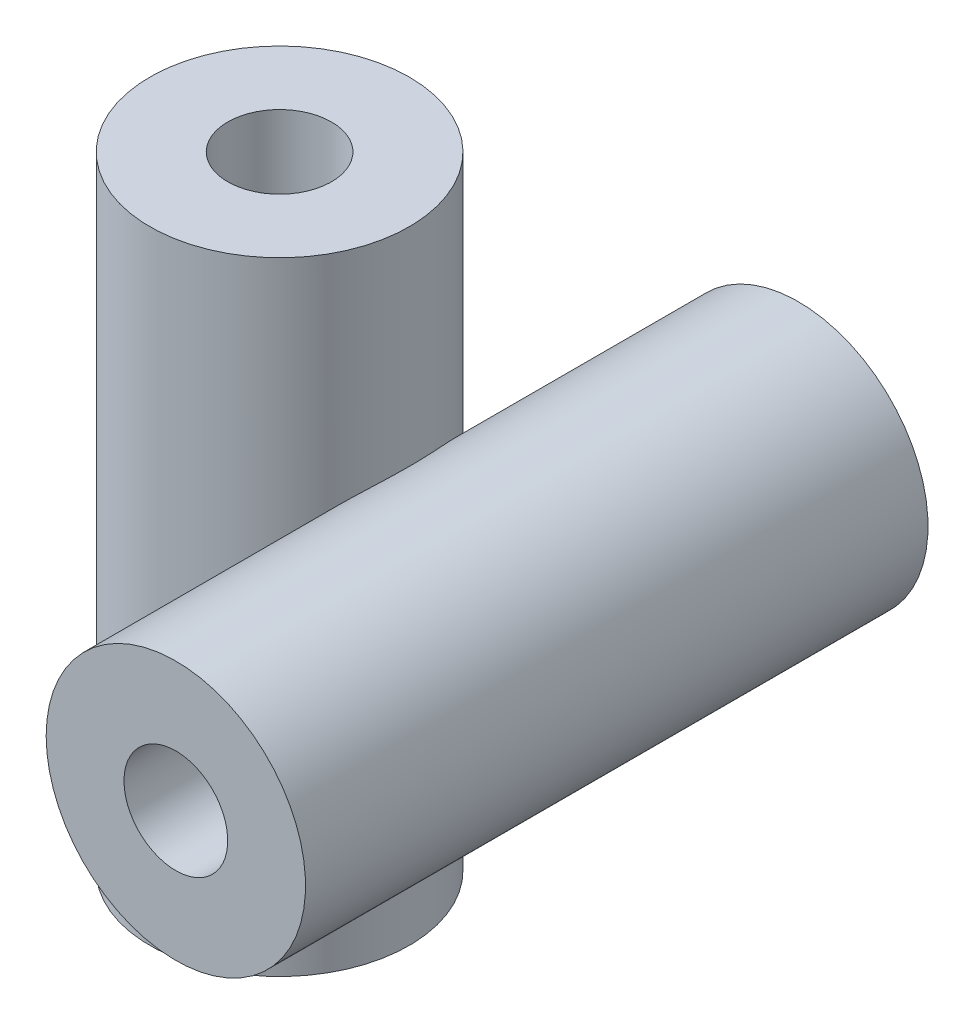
ISO-10303-21;
HEADER;
FILE_DESCRIPTION(('STEP AP214'),'2;1');
FILE_NAME('part.step','',(''),(''),'','','');
FILE_SCHEMA(('AUTOMOTIVE_DESIGN { 1 0 10303 214 1 1 1 1 }'));
ENDSEC;
DATA;
#1=APPLICATION_CONTEXT('core data for automotive mechanical design processes');
#2=APPLICATION_PROTOCOL_DEFINITION('international standard','automotive_design',2000,#1);
#3=PRODUCT_CONTEXT('',#1,'mechanical');
#4=PRODUCT('Part','Part','',(#3));
#5=PRODUCT_RELATED_PRODUCT_CATEGORY('part','',(#4));
#6=PRODUCT_DEFINITION_FORMATION('','',#4);
#7=PRODUCT_DEFINITION_CONTEXT('part definition',#1,'design');
#8=PRODUCT_DEFINITION('design','',#6,#7);
#9=PRODUCT_DEFINITION_SHAPE('','',#8);
#10=(LENGTH_UNIT() NAMED_UNIT(*) SI_UNIT(.MILLI.,.METRE.));
#11=(NAMED_UNIT(*) PLANE_ANGLE_UNIT() SI_UNIT($,.RADIAN.));
#12=(NAMED_UNIT(*) SI_UNIT($,.STERADIAN.) SOLID_ANGLE_UNIT());
#13=UNCERTAINTY_MEASURE_WITH_UNIT(LENGTH_MEASURE(1.E-05),#10,'distance_accuracy_value','');
#14=(GEOMETRIC_REPRESENTATION_CONTEXT(3) GLOBAL_UNCERTAINTY_ASSIGNED_CONTEXT((#13)) GLOBAL_UNIT_ASSIGNED_CONTEXT((#10,
#11,#12)) REPRESENTATION_CONTEXT('',''));
#15=CARTESIAN_POINT('',(0.,0.,0.));
#16=DIRECTION('',(0.,0.,1.));
#17=DIRECTION('',(1.,0.,0.));
#18=AXIS2_PLACEMENT_3D('',#15,#16,#17);
#19=CARTESIAN_POINT('',(15.0000009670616,0.,15.0021082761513));
#20=DIRECTION('',(0.,0.,-1.));
#21=DIRECTION('',(-1.,0.,0.));
#22=AXIS2_PLACEMENT_3D('',#19,#20,#21);
#23=CYLINDRICAL_SURFACE('',#22,6.24999999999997);
#24=CARTESIAN_POINT('',(8.75000096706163,0.,4.99999967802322));
#25=CARTESIAN_POINT('',(8.74999874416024,0.135020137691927,4.99999813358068));
#26=CARTESIAN_POINT('',(8.75437965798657,0.270014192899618,4.99672377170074));
#27=CARTESIAN_POINT('',(8.77183991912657,0.539154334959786,4.98355854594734));
#28=CARTESIAN_POINT('',(8.78492084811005,0.673300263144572,4.97366647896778));
#29=CARTESIAN_POINT('',(8.81961695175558,0.939916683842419,4.94707046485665));
#30=CARTESIAN_POINT('',(8.8412393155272,1.07238566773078,4.93036077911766));
#31=CARTESIAN_POINT('',(8.89269726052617,1.33461259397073,4.8898348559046));
#32=CARTESIAN_POINT('',(8.92253246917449,1.46437065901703,4.86601894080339));
#33=CARTESIAN_POINT('',(8.99001529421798,1.72050794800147,4.81084036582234));
#34=CARTESIAN_POINT('',(9.02767915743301,1.8468795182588,4.77946198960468));
#35=CARTESIAN_POINT('',(9.1101300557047,2.09499615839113,4.70874545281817));
#36=CARTESIAN_POINT('',(9.1549171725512,2.21674117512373,4.66940720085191));
#37=CARTESIAN_POINT('',(9.25073425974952,2.45455804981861,4.58235179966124));
#38=CARTESIAN_POINT('',(9.30176021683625,2.57063348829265,4.53464002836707));
#39=CARTESIAN_POINT('',(9.40901852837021,2.79625013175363,4.43042303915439));
#40=CARTESIAN_POINT('',(9.46525062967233,2.90579165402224,4.37391824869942));
#41=CARTESIAN_POINT('',(9.57976450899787,3.11403222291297,4.25381220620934));
#42=CARTESIAN_POINT('',(9.63792030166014,3.21296793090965,4.19050122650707));
#43=CARTESIAN_POINT('',(9.7566170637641,3.40323349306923,4.05526698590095));
#44=CARTESIAN_POINT('',(9.81715798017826,3.49456351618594,3.9833439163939));
#45=CARTESIAN_POINT('',(9.93919396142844,3.6690692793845,3.83097783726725));
#46=CARTESIAN_POINT('',(10.0006887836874,3.75224705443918,3.75053696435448));
#47=CARTESIAN_POINT('',(10.1231837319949,3.91013297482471,3.58139559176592));
#48=CARTESIAN_POINT('',(10.1841838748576,3.9848414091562,3.49269537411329));
#49=CARTESIAN_POINT('',(10.3007885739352,4.12159071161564,3.31284830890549));
#50=CARTESIAN_POINT('',(10.356501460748,4.18411354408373,3.22213722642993));
#51=CARTESIAN_POINT('',(10.4651041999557,4.30158276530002,3.03429024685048));
#52=CARTESIAN_POINT('',(10.5179930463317,4.35652646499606,2.93715208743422));
#53=CARTESIAN_POINT('',(10.6198971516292,4.45896986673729,2.7371265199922));
#54=CARTESIAN_POINT('',(10.6689131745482,4.50647103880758,2.63424025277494));
#55=CARTESIAN_POINT('',(10.7622235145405,4.59432828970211,2.42334333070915));
#56=CARTESIAN_POINT('',(10.8065156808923,4.63468111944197,2.31533037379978));
#57=CARTESIAN_POINT('',(10.8907019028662,4.70950286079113,2.09206679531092));
#58=CARTESIAN_POINT('',(10.9304509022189,4.74379060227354,1.97670082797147));
#59=CARTESIAN_POINT('',(11.0035208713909,4.80551080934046,1.74221824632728));
#60=CARTESIAN_POINT('',(11.0368442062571,4.83294579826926,1.6231030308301));
#61=CARTESIAN_POINT('',(11.0966079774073,4.88134239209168,1.3817898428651));
#62=CARTESIAN_POINT('',(11.1230440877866,4.90229992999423,1.25958998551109));
#63=CARTESIAN_POINT('',(11.1686371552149,4.9380147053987,1.0129893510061));
#64=CARTESIAN_POINT('',(11.1877962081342,4.95277372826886,0.888589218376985));
#65=CARTESIAN_POINT('',(11.2197030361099,4.97717618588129,0.629333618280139));
#66=CARTESIAN_POINT('',(11.2318932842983,4.98637747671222,0.494367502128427));
#67=CARTESIAN_POINT('',(11.2474703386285,4.99811046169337,0.223637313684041));
#68=CARTESIAN_POINT('',(11.2508567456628,5.00064185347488,0.0878732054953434));
#69=CARTESIAN_POINT('',(11.2487786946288,4.99908326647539,-0.183593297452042));
#70=CARTESIAN_POINT('',(11.2433114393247,4.99499119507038,-0.319295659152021));
#71=CARTESIAN_POINT('',(11.2235963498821,4.98010241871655,-0.589692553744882));
#72=CARTESIAN_POINT('',(11.2093484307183,4.96930564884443,-0.724387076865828));
#73=CARTESIAN_POINT('',(11.1716528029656,4.94032749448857,-0.996333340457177));
#74=CARTESIAN_POINT('',(11.1479132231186,4.92191111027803,-1.13351984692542));
#75=CARTESIAN_POINT('',(11.0916507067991,4.87735426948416,-1.4048113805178));
#76=CARTESIAN_POINT('',(11.059127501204,4.8512135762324,-1.53891631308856));
#77=CARTESIAN_POINT('',(10.9858711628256,4.79077392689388,-1.80294815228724));
#78=CARTESIAN_POINT('',(10.9451402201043,4.75647714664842,-1.93287616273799));
#79=CARTESIAN_POINT('',(10.8562355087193,4.67922782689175,-2.18750996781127));
#80=CARTESIAN_POINT('',(10.8080621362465,4.63627574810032,-2.31221603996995));
#81=CARTESIAN_POINT('',(10.7070499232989,4.54286636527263,-2.55114346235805));
#82=CARTESIAN_POINT('',(10.6544292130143,4.49271889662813,-2.66557806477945));
#83=CARTESIAN_POINT('',(10.5443045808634,4.38352350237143,-2.88765629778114));
#84=CARTESIAN_POINT('',(10.486800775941,4.32447578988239,-2.99530009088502));
#85=CARTESIAN_POINT('',(10.3682676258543,4.19727231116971,-3.20288835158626));
#86=CARTESIAN_POINT('',(10.3072405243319,4.12912230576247,-3.30283762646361));
#87=CARTESIAN_POINT('',(10.1831149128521,3.98362220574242,-3.49440388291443));
#88=CARTESIAN_POINT('',(10.1200165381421,3.90627271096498,-3.58602140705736));
#89=CARTESIAN_POINT('',(9.99790426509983,3.74843356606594,-3.75412752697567));
#90=CARTESIAN_POINT('',(9.93892350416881,3.66857132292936,-3.83123050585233));
#91=CARTESIAN_POINT('',(9.82183684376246,3.50136115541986,-3.97758536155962));
#92=CARTESIAN_POINT('',(9.76373094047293,3.41401326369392,-4.04683727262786));
#93=CARTESIAN_POINT('',(9.64964295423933,3.23228696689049,-4.17742189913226));
#94=CARTESIAN_POINT('',(9.59366102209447,3.13790806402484,-4.23875405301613));
#95=CARTESIAN_POINT('',(9.48498376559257,2.94271345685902,-4.35358294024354));
#96=CARTESIAN_POINT('',(9.43228849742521,2.8418976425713,-4.40707953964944));
#97=CARTESIAN_POINT('',(9.33189440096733,2.63590967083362,-4.50578444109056));
#98=CARTESIAN_POINT('',(9.28413800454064,2.53081414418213,-4.55109434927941));
#99=CARTESIAN_POINT('',(9.19365361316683,2.31569691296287,-4.63460616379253));
#100=CARTESIAN_POINT('',(9.15092764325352,2.20567324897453,-4.6728052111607));
#101=CARTESIAN_POINT('',(9.07122272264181,1.98147523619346,-4.74241052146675));
#102=CARTESIAN_POINT('',(9.03424392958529,1.86730077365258,-4.77381659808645));
#103=CARTESIAN_POINT('',(8.96658748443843,1.63554190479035,-4.83017944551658));
#104=CARTESIAN_POINT('',(8.93591023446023,1.51795728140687,-4.85513580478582));
#105=CARTESIAN_POINT('',(8.87953447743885,1.27249538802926,-4.90031765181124));
#106=CARTESIAN_POINT('',(8.85428059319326,1.14444119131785,-4.92013784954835));
#107=CARTESIAN_POINT('',(8.81175961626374,0.886171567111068,-4.95315288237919));
#108=CARTESIAN_POINT('',(8.79449281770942,0.755956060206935,-4.96634747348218));
#109=CARTESIAN_POINT('',(8.7681785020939,0.494166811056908,-4.98634284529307));
#110=CARTESIAN_POINT('',(8.75913374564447,0.36259262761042,-4.99314147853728));
#111=CARTESIAN_POINT('',(8.74939241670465,0.0989623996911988,-5.00046031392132));
#112=CARTESIAN_POINT('',(8.74869595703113,-0.0330936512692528,-5.00098043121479));
#113=CARTESIAN_POINT('',(8.75585795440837,-0.304298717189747,-4.99560462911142));
#114=CARTESIAN_POINT('',(8.76420061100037,-0.44342817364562,-4.98934557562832));
#115=CARTESIAN_POINT('',(8.79009230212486,-0.720327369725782,-4.96970561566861));
#116=CARTESIAN_POINT('',(8.8076417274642,-0.85809705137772,-4.95632440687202));
#117=CARTESIAN_POINT('',(8.85168160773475,-1.13128770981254,-4.92217793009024));
#118=CARTESIAN_POINT('',(8.87817275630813,-1.26670850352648,-4.90141208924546));
#119=CARTESIAN_POINT('',(8.93966594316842,-1.53416616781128,-4.85212269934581));
#120=CARTESIAN_POINT('',(8.97466778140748,-1.66620311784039,-4.82359933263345));
#121=CARTESIAN_POINT('',(9.05235647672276,-1.92514845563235,-4.75851551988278));
#122=CARTESIAN_POINT('',(9.09500075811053,-2.05208071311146,-4.72199936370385));
#123=CARTESIAN_POINT('',(9.18728760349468,-2.30052639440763,-4.64035843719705));
#124=CARTESIAN_POINT('',(9.23693017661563,-2.4220398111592,-4.59523365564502));
#125=CARTESIAN_POINT('',(9.34213872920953,-2.65853975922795,-4.49595007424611));
#126=CARTESIAN_POINT('',(9.39770075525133,-2.77353056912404,-4.44179729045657));
#127=CARTESIAN_POINT('',(9.51350415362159,-2.99609511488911,-4.32407248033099));
#128=CARTESIAN_POINT('',(9.57374515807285,-3.10366943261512,-4.26050119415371));
#129=CARTESIAN_POINT('',(9.69336574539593,-3.30375686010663,-4.12822571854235));
#130=CARTESIAN_POINT('',(9.75254265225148,-3.39679504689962,-4.06013171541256));
#131=CARTESIAN_POINT('',(9.87235089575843,-3.5750860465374,-3.91554829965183));
#132=CARTESIAN_POINT('',(9.9329821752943,-3.66033916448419,-3.83905921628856));
#133=CARTESIAN_POINT('',(10.054281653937,-3.82264657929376,-3.67789558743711));
#134=CARTESIAN_POINT('',(10.1149498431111,-3.89970252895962,-3.59322269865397));
#135=CARTESIAN_POINT('',(10.2349279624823,-4.0454283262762,-3.41606246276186));
#136=CARTESIAN_POINT('',(10.294237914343,-4.11409830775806,-3.32357524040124));
#137=CARTESIAN_POINT('',(10.4073137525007,-4.23987321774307,-3.13605878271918));
#138=CARTESIAN_POINT('',(10.4612088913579,-4.2973800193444,-3.04137631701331));
#139=CARTESIAN_POINT('',(10.5655221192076,-4.40494202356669,-2.84600454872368));
#140=CARTESIAN_POINT('',(10.6159390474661,-4.45499474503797,-2.74531326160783));
#141=CARTESIAN_POINT('',(10.7123411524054,-4.54785159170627,-2.53863586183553));
#142=CARTESIAN_POINT('',(10.7583270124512,-4.59065683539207,-2.43265056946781));
#143=CARTESIAN_POINT('',(10.8451119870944,-4.66935023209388,-2.2160324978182));
#144=CARTESIAN_POINT('',(10.8859087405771,-4.70523524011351,-2.10539763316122));
#145=CARTESIAN_POINT('',(10.9631343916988,-4.7716774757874,-1.87583953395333));
#146=CARTESIAN_POINT('',(10.9993296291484,-4.80197098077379,-1.75676138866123));
#147=CARTESIAN_POINT('',(11.0648233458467,-4.85578762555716,-1.51528137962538));
#148=CARTESIAN_POINT('',(11.0941243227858,-4.87931321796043,-1.39288073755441));
#149=CARTESIAN_POINT('',(11.1454431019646,-4.91995493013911,-1.1454336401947));
#150=CARTESIAN_POINT('',(11.1674561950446,-4.93706690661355,-1.02038552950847));
#151=CARTESIAN_POINT('',(11.203872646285,-4.96512208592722,-0.768545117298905));
#152=CARTESIAN_POINT('',(11.218278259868,-4.97606711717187,-0.64175334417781));
#153=CARTESIAN_POINT('',(11.2400427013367,-4.99253606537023,-0.378230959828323));
#154=CARTESIAN_POINT('',(11.2468373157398,-4.99762660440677,-0.241426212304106));
#155=CARTESIAN_POINT('',(11.2514171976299,-5.00106259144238,0.0324220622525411));
#156=CARTESIAN_POINT('',(11.24920204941,-4.99940772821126,0.169465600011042));
#157=CARTESIAN_POINT('',(11.2357910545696,-4.98931803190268,0.442902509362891));
#158=CARTESIAN_POINT('',(11.2245926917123,-4.98088129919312,0.57929568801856));
#159=CARTESIAN_POINT('',(11.193372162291,-4.95706183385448,0.850457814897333));
#160=CARTESIAN_POINT('',(11.1733499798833,-4.94167908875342,0.985226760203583));
#161=CARTESIAN_POINT('',(11.1242125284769,-4.90323977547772,1.25531133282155));
#162=CARTESIAN_POINT('',(11.0948957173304,-4.88001229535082,1.39056615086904));
#163=CARTESIAN_POINT('',(11.0278243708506,-4.82557530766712,1.65733486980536));
#164=CARTESIAN_POINT('',(10.9900696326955,-4.79436560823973,1.78884868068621));
#165=CARTESIAN_POINT('',(10.906829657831,-4.72349799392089,2.04701215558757));
#166=CARTESIAN_POINT('',(10.8613474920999,-4.68384343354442,2.17366372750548));
#167=CARTESIAN_POINT('',(10.7635566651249,-4.5955820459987,2.42107700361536));
#168=CARTESIAN_POINT('',(10.7112484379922,-4.54697578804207,2.54183908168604));
#169=CARTESIAN_POINT('',(10.6034200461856,-4.44274027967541,2.77119650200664));
#170=CARTESIAN_POINT('',(10.5481470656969,-4.38752077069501,2.88009424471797));
#171=CARTESIAN_POINT('',(10.4336335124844,-4.26821048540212,3.09071224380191));
#172=CARTESIAN_POINT('',(10.3743930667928,-4.20411999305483,3.19243272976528));
#173=CARTESIAN_POINT('',(10.2533629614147,-4.06697465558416,3.38790422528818));
#174=CARTESIAN_POINT('',(10.1915747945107,-3.99392501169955,3.48165980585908));
#175=CARTESIAN_POINT('',(10.0669258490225,-3.83890031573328,3.66069240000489));
#176=CARTESIAN_POINT('',(10.0040651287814,-3.7569257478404,3.74596987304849));
#177=CARTESIAN_POINT('',(9.88318819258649,-3.59034383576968,3.90205599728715));
#178=CARTESIAN_POINT('',(9.82513892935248,-3.50631547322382,3.97345832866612));
#179=CARTESIAN_POINT('',(9.71069987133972,-3.33117602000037,4.10848480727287));
#180=CARTESIAN_POINT('',(9.65431009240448,-3.24006486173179,4.17210888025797));
#181=CARTESIAN_POINT('',(9.54434212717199,-3.0512660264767,4.29162682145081));
#182=CARTESIAN_POINT('',(9.49076482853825,-2.95357629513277,4.34751825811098));
#183=CARTESIAN_POINT('',(9.38749369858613,-2.75228241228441,4.45171742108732));
#184=CARTESIAN_POINT('',(9.33779993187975,-2.64867816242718,4.50002502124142));
#185=CARTESIAN_POINT('',(9.2431167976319,-2.43605321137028,4.58941333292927));
#186=CARTESIAN_POINT('',(9.19813693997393,-2.32702219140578,4.63047954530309));
#187=CARTESIAN_POINT('',(9.11374558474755,-2.10444084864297,4.70561326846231));
#188=CARTESIAN_POINT('',(9.07433618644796,-1.99088884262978,4.739678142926));
#189=CARTESIAN_POINT('',(9.00175180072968,-1.76014784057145,4.80111961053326));
#190=CARTESIAN_POINT('',(8.96857203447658,-1.64296171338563,4.82850133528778));
#191=CARTESIAN_POINT('',(8.90888141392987,-1.40561471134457,4.87694791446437));
#192=CARTESIAN_POINT('',(8.88237194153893,-1.2854532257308,4.89801146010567));
#193=CARTESIAN_POINT('',(8.82329784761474,-0.973816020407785,4.94439587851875));
#194=CARTESIAN_POINT('',(8.79587323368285,-0.780673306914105,4.96531744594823));
#195=CARTESIAN_POINT('',(8.75922558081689,-0.391668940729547,4.99312110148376));
#196=CARTESIAN_POINT('',(8.75000419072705,-0.19580704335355,5.00000191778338));
#197=CARTESIAN_POINT('',(8.75000096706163,0.,4.99999967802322));
#198=B_SPLINE_CURVE_WITH_KNOTS('',3,(#24,#25,#26,#27,#28,#29,#30,#31,#32,#33,#34,#35,#36,#37,
#38,#39,#40,#41,#42,#43,#44,#45,#46,#47,#48,#49,#50,#51,#52,#53,#54,#55,#56,#57,#58,#59,#60,#61,
#62,#63,#64,#65,#66,#67,#68,#69,#70,#71,#72,#73,#74,#75,#76,#77,#78,#79,#80,#81,#82,#83,#84,#85,
#86,#87,#88,#89,#90,#91,#92,#93,#94,#95,#96,#97,#98,#99,#100,#101,#102,#103,#104,#105,#106,#107,
#108,#109,#110,#111,#112,#113,#114,#115,#116,#117,#118,#119,#120,#121,#122,#123,#124,#125,#126,
#127,#128,#129,#130,#131,#132,#133,#134,#135,#136,#137,#138,#139,#140,#141,#142,#143,#144,#145,
#146,#147,#148,#149,#150,#151,#152,#153,#154,#155,#156,#157,#158,#159,#160,#161,#162,#163,#164,
#165,#166,#167,#168,#169,#170,#171,#172,#173,#174,#175,#176,#177,#178,#179,#180,#181,#182,#183,
#184,#185,#186,#187,#188,#189,#190,#191,#192,#193,#194,#195,#196,#197),.UNSPECIFIED.,.T.,.F.,(4,
2,2,2,2,2,2,2,2,2,2,2,2,2,2,2,2,2,2,2,2,2,2,2,2,2,2,2,2,2,2,2,2,2,2,2,2,2,2,2,2,2,2,2,2,2,2,2,2,
2,2,2,2,2,2,2,2,2,2,2,2,2,2,2,2,2,2,2,2,2,2,2,2,2,2,2,2,2,2,2,2,2,2,2,2,2,4),(0.,
0.404904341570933,0.809882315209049,1.21520187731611,1.62050305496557,2.02665390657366,
2.43280942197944,2.8387050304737,3.24458091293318,3.63726755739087,4.02994547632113,
4.42252512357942,4.81509137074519,5.18502866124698,5.55509686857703,5.92509188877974,
6.29525465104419,6.67508380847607,7.05477289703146,7.43469989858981,7.81451739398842,
8.22154058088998,8.62858221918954,9.03575248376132,9.44292669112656,9.86372484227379,
10.2845358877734,10.7052347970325,11.1259113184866,11.5320832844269,11.9382455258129,
12.3441519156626,12.7500318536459,13.1266788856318,13.5033242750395,13.8799963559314,
14.256674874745,14.6282977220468,15.0000696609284,15.3718517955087,15.7436576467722,
16.1392728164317,16.5349025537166,16.9306650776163,17.3264329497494,17.7444986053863,
18.1625820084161,18.58069785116,18.9988038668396,19.4146492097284,19.8304950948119,
20.2460649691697,20.6616022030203,21.0498833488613,21.4381492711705,21.8263367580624,
22.2145180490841,22.5836734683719,22.952951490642,23.3221724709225,23.6915608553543,
24.0754170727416,24.4591340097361,24.8430984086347,25.2269489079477,25.6376838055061,
26.0484376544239,26.4593065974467,26.870176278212,27.2906465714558,27.7111269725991,
28.1314406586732,28.5517276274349,28.9532760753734,29.3548116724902,29.756115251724,
30.1573970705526,30.5307884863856,30.9041834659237,31.2776955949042,31.6512139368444,
32.0254718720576,32.3998704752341,32.7739806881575,33.1481683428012,33.7353099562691,
34.3225047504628),.UNSPECIFIED.);
#199=CARTESIAN_POINT('',(8.75000096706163,0.,4.99999967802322));
#200=VERTEX_POINT('',#199);
#201=EDGE_CURVE('E10',#200,#200,#198,.T.);
#202=ORIENTED_EDGE('',*,*,#201,.F.);
#203=EDGE_LOOP('',(#202));
#204=FACE_BOUND('',#203,.T.);
#205=CARTESIAN_POINT('',(15.0000009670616,0.,14.9999996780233));
#206=DIRECTION('',(0.,0.,-1.));
#207=DIRECTION('',(-1.,0.,0.));
#208=AXIS2_PLACEMENT_3D('',#205,#206,#207);
#209=CIRCLE('',#208,6.24999999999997);
#210=CARTESIAN_POINT('',(8.75000096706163,0.,14.9999996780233));
#211=VERTEX_POINT('',#210);
#212=EDGE_CURVE('E41',#211,#211,#209,.T.);
#213=ORIENTED_EDGE('',*,*,#212,.T.);
#214=EDGE_LOOP('',(#213));
#215=FACE_BOUND('',#214,.T.);
#216=CARTESIAN_POINT('',(15.0000009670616,0.,-15.0000003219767));
#217=DIRECTION('',(0.,0.,-1.));
#218=DIRECTION('',(-1.,0.,0.));
#219=AXIS2_PLACEMENT_3D('',#216,#217,#218);
#220=CIRCLE('',#219,6.24999999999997);
#221=CARTESIAN_POINT('',(8.75000096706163,0.,-15.0000003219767));
#222=VERTEX_POINT('',#221);
#223=EDGE_CURVE('E45',#222,#222,#220,.T.);
#224=ORIENTED_EDGE('',*,*,#223,.F.);
#225=EDGE_LOOP('',(#224));
#226=FACE_BOUND('',#225,.T.);
#227=ADVANCED_FACE('F31',(#204,#215,#226),#23,.T.);
#228=CARTESIAN_POINT('',(21.2500009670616,0.,14.9999996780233));
#229=DIRECTION('',(0.,0.,1.));
#230=DIRECTION('',(1.,0.,0.));
#231=AXIS2_PLACEMENT_3D('',#228,#229,#230);
#232=PLANE('',#231);
#233=CARTESIAN_POINT('',(15.0000009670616,-1.52534652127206E-06,14.9999996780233));
#234=DIRECTION('',(0.,0.,-1.));
#235=DIRECTION('',(-1.,0.,0.));
#236=AXIS2_PLACEMENT_3D('',#233,#234,#235);
#237=CIRCLE('',#236,2.49999999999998);
#238=CARTESIAN_POINT('',(12.5000009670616,-1.52534652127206E-06,14.9999996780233));
#239=VERTEX_POINT('',#238);
#240=EDGE_CURVE('E63',#239,#239,#237,.T.);
#241=ORIENTED_EDGE('',*,*,#240,.T.);
#242=EDGE_LOOP('',(#241));
#243=FACE_BOUND('',#242,.T.);
#244=ORIENTED_EDGE('',*,*,#212,.F.);
#245=EDGE_LOOP('',(#244));
#246=FACE_BOUND('',#245,.T.);
#247=ADVANCED_FACE('F76',(#243,#246),#232,.T.);
#248=CARTESIAN_POINT('',(15.0000009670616,0.,-15.0000003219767));
#249=DIRECTION('',(0.,0.,-1.));
#250=DIRECTION('',(-1.,0.,0.));
#251=AXIS2_PLACEMENT_3D('',#248,#249,#250);
#252=PLANE('',#251);
#253=CARTESIAN_POINT('',(15.0000009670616,-1.52534652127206E-06,-15.0000003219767));
#254=DIRECTION('',(0.,0.,-1.));
#255=DIRECTION('',(-1.,0.,0.));
#256=AXIS2_PLACEMENT_3D('',#253,#254,#255);
#257=CIRCLE('',#256,2.49999999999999);
#258=CARTESIAN_POINT('',(12.5000009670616,-1.52534652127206E-06,-15.0000003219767));
#259=VERTEX_POINT('',#258);
#260=EDGE_CURVE('E66',#259,#259,#257,.T.);
#261=ORIENTED_EDGE('',*,*,#260,.F.);
#262=EDGE_LOOP('',(#261));
#263=FACE_BOUND('',#262,.T.);
#264=ORIENTED_EDGE('',*,*,#223,.T.);
#265=EDGE_LOOP('',(#264));
#266=FACE_BOUND('',#265,.T.);
#267=ADVANCED_FACE('F72',(#263,#266),#252,.T.);
#268=CARTESIAN_POINT('',(5.00000096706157,-15.0000015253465,-3.21976739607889E-07));
#269=DIRECTION('',(0.,-1.,0.));
#270=DIRECTION('',(0.,0.,-1.));
#271=AXIS2_PLACEMENT_3D('',#268,#269,#270);
#272=PLANE('',#271);
#273=CARTESIAN_POINT('',(5.00000096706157,-15.0000015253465,-3.21976739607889E-07));
#274=DIRECTION('',(0.,-1.,0.));
#275=DIRECTION('',(0.,0.,-1.));
#276=AXIS2_PLACEMENT_3D('',#273,#274,#275);
#277=CIRCLE('',#276,2.49999999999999);
#278=CARTESIAN_POINT('',(5.00000096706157,-15.0000015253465,-2.50000032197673));
#279=VERTEX_POINT('',#278);
#280=EDGE_CURVE('E60',#279,#279,#277,.T.);
#281=ORIENTED_EDGE('',*,*,#280,.F.);
#282=EDGE_LOOP('',(#281));
#283=FACE_BOUND('',#282,.T.);
#284=CARTESIAN_POINT('',(5.00000096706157,-15.0000015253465,-3.21976739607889E-07));
#285=DIRECTION('',(0.,-1.,0.));
#286=DIRECTION('',(0.,0.,-1.));
#287=AXIS2_PLACEMENT_3D('',#284,#285,#286);
#288=CIRCLE('',#287,6.25);
#289=CARTESIAN_POINT('',(5.00000096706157,-15.0000015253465,-6.25000032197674));
#290=VERTEX_POINT('',#289);
#291=EDGE_CURVE('E49',#290,#290,#288,.T.);
#292=ORIENTED_EDGE('',*,*,#291,.T.);
#293=EDGE_LOOP('',(#292));
#294=FACE_BOUND('',#293,.T.);
#295=ADVANCED_FACE('F75',(#283,#294),#272,.T.);
#296=CARTESIAN_POINT('',(5.00000096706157,14.9999984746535,-3.21976739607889E-07));
#297=DIRECTION('',(0.,-1.,0.));
#298=DIRECTION('',(0.,0.,-1.));
#299=AXIS2_PLACEMENT_3D('',#296,#297,#298);
#300=CYLINDRICAL_SURFACE('',#299,6.25);
#301=ORIENTED_EDGE('',*,*,#201,.T.);
#302=EDGE_LOOP('',(#301));
#303=FACE_BOUND('',#302,.T.);
#304=CARTESIAN_POINT('',(5.00000096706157,14.9999984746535,-3.21976739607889E-07));
#305=DIRECTION('',(0.,-1.,0.));
#306=DIRECTION('',(0.,0.,-1.));
#307=AXIS2_PLACEMENT_3D('',#304,#305,#306);
#308=CIRCLE('',#307,6.25);
#309=CARTESIAN_POINT('',(5.00000096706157,14.9999984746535,-6.25000032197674));
#310=VERTEX_POINT('',#309);
#311=EDGE_CURVE('E54',#310,#310,#308,.T.);
#312=ORIENTED_EDGE('',*,*,#311,.T.);
#313=EDGE_LOOP('',(#312));
#314=FACE_BOUND('',#313,.T.);
#315=ORIENTED_EDGE('',*,*,#291,.F.);
#316=EDGE_LOOP('',(#315));
#317=FACE_BOUND('',#316,.T.);
#318=ADVANCED_FACE('F91',(#303,#314,#317),#300,.T.);
#319=CARTESIAN_POINT('',(5.00000096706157,14.9999984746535,-6.25000032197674));
#320=DIRECTION('',(0.,1.,0.));
#321=DIRECTION('',(0.,0.,1.));
#322=AXIS2_PLACEMENT_3D('',#319,#320,#321);
#323=PLANE('',#322);
#324=CARTESIAN_POINT('',(5.00000096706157,14.9999984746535,-3.21976739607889E-07));
#325=DIRECTION('',(0.,-1.,0.));
#326=DIRECTION('',(0.,0.,-1.));
#327=AXIS2_PLACEMENT_3D('',#324,#325,#326);
#328=CIRCLE('',#327,2.49999999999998);
#329=CARTESIAN_POINT('',(5.00000096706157,14.9999984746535,-2.50000032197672));
#330=VERTEX_POINT('',#329);
#331=EDGE_CURVE('E57',#330,#330,#328,.T.);
#332=ORIENTED_EDGE('',*,*,#331,.T.);
#333=EDGE_LOOP('',(#332));
#334=FACE_BOUND('',#333,.T.);
#335=ORIENTED_EDGE('',*,*,#311,.F.);
#336=EDGE_LOOP('',(#335));
#337=FACE_BOUND('',#336,.T.);
#338=ADVANCED_FACE('F96',(#334,#337),#323,.T.);
#339=CARTESIAN_POINT('',(5.00000096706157,-15.0000015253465,-3.21976739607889E-07));
#340=DIRECTION('',(0.,-1.,0.));
#341=DIRECTION('',(0.,0.,-1.));
#342=AXIS2_PLACEMENT_3D('',#339,#340,#341);
#343=CYLINDRICAL_SURFACE('',#342,2.49999999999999);
#344=ORIENTED_EDGE('',*,*,#331,.F.);
#345=EDGE_LOOP('',(#344));
#346=FACE_BOUND('',#345,.T.);
#347=ORIENTED_EDGE('',*,*,#280,.T.);
#348=EDGE_LOOP('',(#347));
#349=FACE_BOUND('',#348,.T.);
#350=ADVANCED_FACE('F99',(#346,#349),#343,.F.);
#351=CARTESIAN_POINT('',(15.0000009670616,-1.52534652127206E-06,-15.0000003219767));
#352=DIRECTION('',(0.,0.,-1.));
#353=DIRECTION('',(-1.,0.,0.));
#354=AXIS2_PLACEMENT_3D('',#351,#352,#353);
#355=CYLINDRICAL_SURFACE('',#354,2.49999999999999);
#356=ORIENTED_EDGE('',*,*,#240,.F.);
#357=EDGE_LOOP('',(#356));
#358=FACE_BOUND('',#357,.T.);
#359=ORIENTED_EDGE('',*,*,#260,.T.);
#360=EDGE_LOOP('',(#359));
#361=FACE_BOUND('',#360,.T.);
#362=ADVANCED_FACE('F70',(#358,#361),#355,.F.);
#363=CLOSED_SHELL('',(#227,#247,#267,#295,#318,#338,#350,#362));
#364=MANIFOLD_SOLID_BREP('B2',#363);
#365=ADVANCED_BREP_SHAPE_REPRESENTATION('',(#18,#364),#14);
#366=SHAPE_DEFINITION_REPRESENTATION(#9,#365);
ENDSEC;
END-ISO-10303-21;
